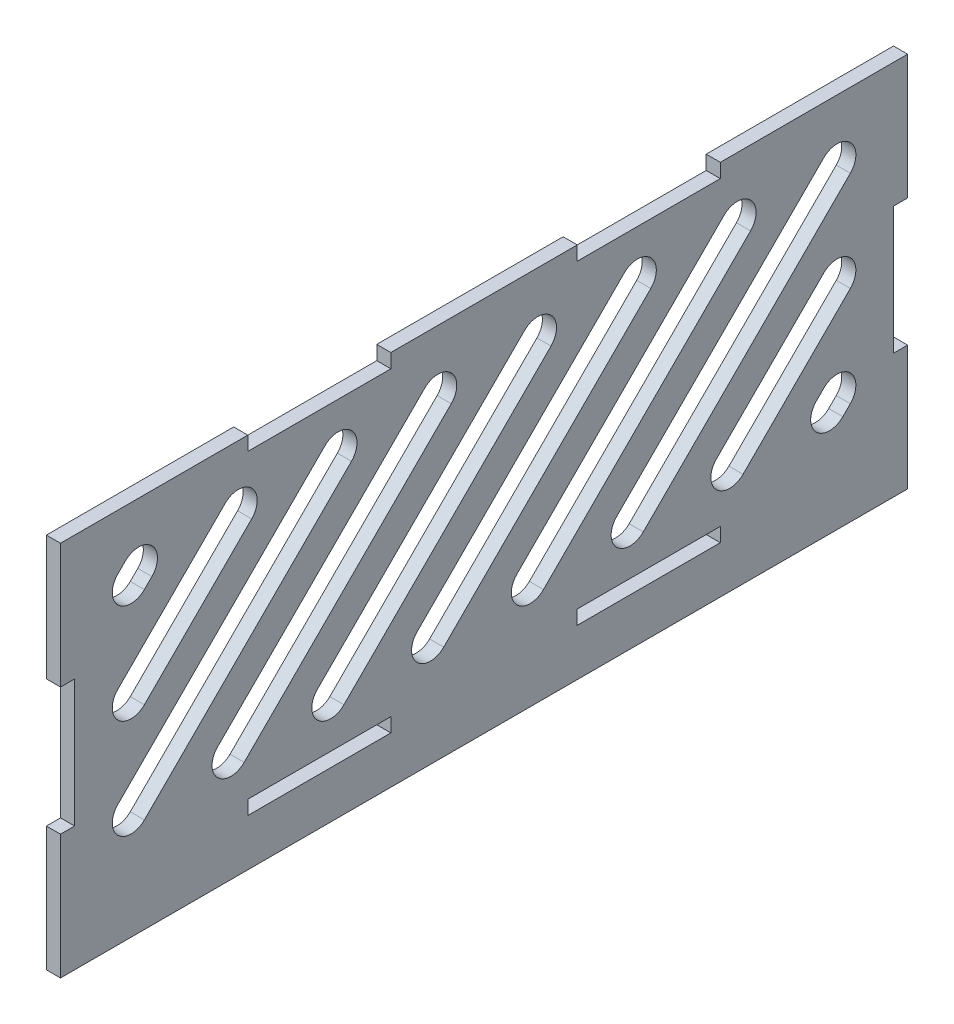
from build123d import *

# Parameters (mm, degrees)
SKETCH1_W           = 180
SKETCH1_H           = 80
BOSS_EXTRUDE1_DEPTH = 3
SKETCH2_W           = 30.4
SKETCH2_H           = 3
CUT_EXTRUDE1_DEPTH  = 3
SKETCH3_W           = 3
SKETCH3_H           = 26.666666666
SKETCH3_H_2         = 0.2
CUT_EXTRUDE2_DEPTH  = 3
LPATTERN1_COUNT     = 2
LPATTERN1_PITCH     = 67
CUT_EXTRUDE3_DEPTH  = 10
LPATTERN2_COUNT     = 6
LPATTERN2_PITCH     = 21.2
CUT_EXTRUDE4_DEPTH  = 10


with BuildPart() as part:
    # Sketch1 → Boss-Extrude1 (new body)
    with BuildSketch(Plane(origin=(0, 0, 0), x_dir=(0, 0, -1), z_dir=(1, 0, 0))):
        Rectangle(SKETCH1_W, SKETCH1_H)
    extrude(amount=BOSS_EXTRUDE1_DEPTH)

    # Sketch2 → Cut-Extrude1 (cut)
    with BuildSketch(Plane.ZY):
        with Locations((-35, -28.5)):
            Rectangle(SKETCH2_W, SKETCH2_H)
        with Locations((35, -28.5)):
            Rectangle(SKETCH2_W, SKETCH2_H)
    cut_extrude1 = extrude(amount=-CUT_EXTRUDE1_DEPTH, mode=Mode.SUBTRACT)

    # Sketch3 → Cut-Extrude2 (cut)
    with BuildSketch(Plane.ZY):
        with Locations((88.5, 0)):
            Rectangle(SKETCH3_W, SKETCH3_H)
        with Locations((88.5, 13.433333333)):
            Rectangle(SKETCH3_W, SKETCH3_H_2)
        with Locations((88.5, -13.433333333)):
            Rectangle(SKETCH3_W, SKETCH3_H_2)
    cut_extrude2 = extrude(amount=-CUT_EXTRUDE2_DEPTH, mode=Mode.SUBTRACT)

    # Mirror1: Cut-Extrude2 across plane
    add(cut_extrude2.mirror(Plane.XY), mode=Mode.SUBTRACT)

    # LPattern1: Cut-Extrude1 ×2
    with Locations(*[(0, i * LPATTERN1_PITCH, 0) for i in range(1, LPATTERN1_COUNT)]):
        add(cut_extrude1, mode=Mode.SUBTRACT)

    # Sketch4 → Cut-Extrude3 (cut)
    with BuildSketch(Plane(origin=(3, 0, 0), x_dir=(0, 0, -1), z_dir=(1, 0, 0))):
        with BuildLine():
            Line((-33.828427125, 29.828427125), (-77.828427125, -14.171572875))
            ThreePointArc((-77.828427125, -14.171572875), (-77.828427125, -19.828427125), (-72.171572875, -19.828427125))
            Line((-72.171572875, -19.828427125), (-28.171572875, 24.171572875))
            ThreePointArc((-28.171572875, 24.171572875), (-28.171572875, 29.828427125), (-33.828427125, 29.828427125))
        make_face()
    cut_extrude3 = extrude(amount=-CUT_EXTRUDE3_DEPTH, mode=Mode.SUBTRACT)

    # LPattern2: Cut-Extrude3 ×6
    with Locations(*[(0, 0, -i * LPATTERN2_PITCH) for i in range(1, LPATTERN2_COUNT)]):
        add(cut_extrude3, mode=Mode.SUBTRACT)

    # Sketch5 → Cut-Extrude4 (cut)
    with BuildSketch(Plane(origin=(3, 0, 0), x_dir=(0, 0, -1), z_dir=(1, 0, 0))):
        with BuildLine():
            Line((-49.371572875, 24.171572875), (-72.171572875, 1.371572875))
            ThreePointArc((-72.171572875, 1.371572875), (-77.828427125, 1.371572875), (-77.828427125, 7.028427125))
            Line((-77.828427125, 7.028427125), (-55.028427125, 29.828427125))
            ThreePointArc((-55.028427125, 29.828427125), (-49.371572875, 29.828427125), (-49.371572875, 24.171572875))
        make_face()
        with BuildLine():
            Line((49.371572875, -14.171572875), (72.171572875, 8.628427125))
            ThreePointArc((72.171572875, 8.628427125), (77.828427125, 8.628427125), (77.828427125, 2.971572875))
            Line((77.828427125, 2.971572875), (55.028427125, -19.828427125))
            ThreePointArc((55.028427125, -19.828427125), (49.371572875, -19.828427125), (49.371572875, -14.171572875))
        make_face()
        with BuildLine():
            Line((-70.571572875, 24.171572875), (-72.171572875, 22.571572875))
            ThreePointArc((-72.171572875, 22.571572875), (-77.828427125, 22.571572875), (-77.828427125, 28.228427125))
            Line((-77.828427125, 28.228427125), (-76.228427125, 29.828427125))
            ThreePointArc((-76.228427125, 29.828427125), (-70.571572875, 29.828427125), (-70.571572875, 24.171572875))
        make_face()
        with BuildLine():
            Line((70.571572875, -14.171572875), (72.171572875, -12.571572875))
            ThreePointArc((72.171572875, -12.571572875), (77.828427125, -12.571572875), (77.828427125, -18.228427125))
            Line((77.828427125, -18.228427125), (76.228427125, -19.828427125))
            ThreePointArc((76.228427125, -19.828427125), (70.571572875, -19.828427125), (70.571572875, -14.171572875))
        make_face()
    extrude(amount=-CUT_EXTRUDE4_DEPTH, mode=Mode.SUBTRACT)


solid = part.part
